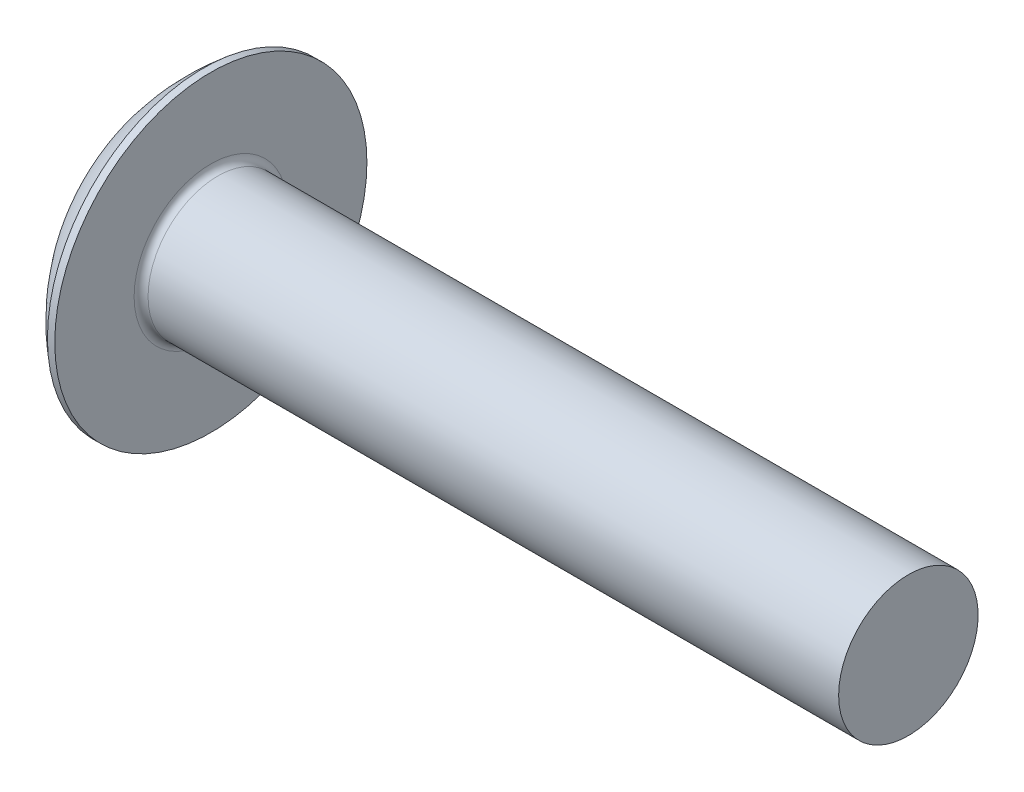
ISO-10303-21;
HEADER;
FILE_DESCRIPTION(('STEP AP214'),'2;1');
FILE_NAME('part.step','',(''),(''),'','','');
FILE_SCHEMA(('AUTOMOTIVE_DESIGN { 1 0 10303 214 1 1 1 1 }'));
ENDSEC;
DATA;
#1=APPLICATION_CONTEXT('core data for automotive mechanical design processes');
#2=APPLICATION_PROTOCOL_DEFINITION('international standard','automotive_design',2000,#1);
#3=PRODUCT_CONTEXT('',#1,'mechanical');
#4=PRODUCT('Part','Part','',(#3));
#5=PRODUCT_RELATED_PRODUCT_CATEGORY('part','',(#4));
#6=PRODUCT_DEFINITION_FORMATION('','',#4);
#7=PRODUCT_DEFINITION_CONTEXT('part definition',#1,'design');
#8=PRODUCT_DEFINITION('design','',#6,#7);
#9=PRODUCT_DEFINITION_SHAPE('','',#8);
#10=(LENGTH_UNIT() NAMED_UNIT(*) SI_UNIT(.MILLI.,.METRE.));
#11=(NAMED_UNIT(*) PLANE_ANGLE_UNIT() SI_UNIT($,.RADIAN.));
#12=(NAMED_UNIT(*) SI_UNIT($,.STERADIAN.) SOLID_ANGLE_UNIT());
#13=UNCERTAINTY_MEASURE_WITH_UNIT(LENGTH_MEASURE(1.E-05),#10,'distance_accuracy_value','');
#14=(GEOMETRIC_REPRESENTATION_CONTEXT(3) GLOBAL_UNCERTAINTY_ASSIGNED_CONTEXT((#13)) GLOBAL_UNIT_ASSIGNED_CONTEXT((#10,
#11,#12)) REPRESENTATION_CONTEXT('',''));
#15=CARTESIAN_POINT('',(0.,0.,0.));
#16=DIRECTION('',(0.,0.,1.));
#17=DIRECTION('',(1.,0.,0.));
#18=AXIS2_PLACEMENT_3D('',#15,#16,#17);
#19=CARTESIAN_POINT('',(11.5,0.,0.));
#20=DIRECTION('',(-1.,0.,0.));
#21=DIRECTION('',(0.,1.,0.));
#22=AXIS2_PLACEMENT_3D('',#19,#20,#21);
#23=SPHERICAL_SURFACE('',#22,11.5);
#24=CARTESIAN_POINT('',(4.27867740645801,0.,0.));
#25=DIRECTION('',(-1.,0.,0.));
#26=DIRECTION('',(0.,0.,1.));
#27=AXIS2_PLACEMENT_3D('',#24,#25,#26);
#28=CIRCLE('',#27,8.95);
#29=CARTESIAN_POINT('',(4.27867740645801,0.,8.95));
#30=VERTEX_POINT('',#29);
#31=EDGE_CURVE('E77',#30,#30,#28,.T.);
#32=ORIENTED_EDGE('',*,*,#31,.T.);
#33=EDGE_LOOP('',(#32));
#34=FACE_BOUND('',#33,.T.);
#35=CARTESIAN_POINT('',(2.17,0.,0.));
#36=DIRECTION('',(-1.,0.,0.));
#37=DIRECTION('',(0.,0.,1.));
#38=AXIS2_PLACEMENT_3D('',#35,#36,#37);
#39=CIRCLE('',#38,6.72317633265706);
#40=CARTESIAN_POINT('',(2.17,1.155,-6.62322240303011));
#41=VERTEX_POINT('',#40);
#42=CARTESIAN_POINT('',(2.17,-1.155,-6.62322240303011));
#43=VERTEX_POINT('',#42);
#44=EDGE_CURVE('E11',#41,#43,#39,.T.);
#45=ORIENTED_EDGE('',*,*,#44,.F.);
#46=CARTESIAN_POINT('',(11.5,1.155,0.));
#47=DIRECTION('',(0.,-1.,0.));
#48=DIRECTION('',(0.,0.,-1.));
#49=AXIS2_PLACEMENT_3D('',#46,#47,#48);
#50=CIRCLE('',#49,11.4418519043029);
#51=CARTESIAN_POINT('',(2.17,1.155,6.62322240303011));
#52=VERTEX_POINT('',#51);
#53=EDGE_CURVE('E37',#52,#41,#50,.T.);
#54=ORIENTED_EDGE('',*,*,#53,.F.);
#55=CARTESIAN_POINT('',(2.17,-1.155,6.62322240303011));
#56=VERTEX_POINT('',#55);
#57=EDGE_CURVE('E43',#56,#52,#39,.T.);
#58=ORIENTED_EDGE('',*,*,#57,.F.);
#59=CARTESIAN_POINT('',(11.5,-1.155,0.));
#60=DIRECTION('',(0.,1.,0.));
#61=DIRECTION('',(0.,0.,1.));
#62=AXIS2_PLACEMENT_3D('',#59,#60,#61);
#63=CIRCLE('',#62,11.4418519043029);
#64=EDGE_CURVE('E65',#43,#56,#63,.T.);
#65=ORIENTED_EDGE('',*,*,#64,.F.);
#66=EDGE_LOOP('',(#45,#54,#58,#65));
#67=FACE_BOUND('',#66,.T.);
#68=ADVANCED_FACE('F33',(#34,#67),#23,.T.);
#69=CARTESIAN_POINT('',(0.,0.,0.));
#70=DIRECTION('',(-1.,0.,0.));
#71=DIRECTION('',(0.,0.,1.));
#72=AXIS2_PLACEMENT_3D('',#69,#70,#71);
#73=CYLINDRICAL_SURFACE('',#72,8.95);
#74=ORIENTED_EDGE('',*,*,#31,.F.);
#75=EDGE_LOOP('',(#74));
#76=FACE_BOUND('',#75,.T.);
#77=CARTESIAN_POINT('',(4.7,0.,0.));
#78=DIRECTION('',(-1.,0.,0.));
#79=DIRECTION('',(0.,0.,1.));
#80=AXIS2_PLACEMENT_3D('',#77,#78,#79);
#81=CIRCLE('',#80,8.95);
#82=CARTESIAN_POINT('',(4.7,0.,8.95));
#83=VERTEX_POINT('',#82);
#84=EDGE_CURVE('E80',#83,#83,#81,.T.);
#85=ORIENTED_EDGE('',*,*,#84,.T.);
#86=EDGE_LOOP('',(#85));
#87=FACE_BOUND('',#86,.T.);
#88=ADVANCED_FACE('F96',(#76,#87),#73,.T.);
#89=CARTESIAN_POINT('',(4.7,8.95,0.));
#90=DIRECTION('',(-1.,0.,0.));
#91=DIRECTION('',(0.,0.,1.));
#92=AXIS2_PLACEMENT_3D('',#89,#90,#91);
#93=PLANE('',#92);
#94=CARTESIAN_POINT('',(4.7,0.,0.));
#95=DIRECTION('',(-1.,0.,0.));
#96=DIRECTION('',(0.,0.,1.));
#97=AXIS2_PLACEMENT_3D('',#94,#95,#96);
#98=CIRCLE('',#97,4.4);
#99=CARTESIAN_POINT('',(4.7,0.,4.4));
#100=VERTEX_POINT('',#99);
#101=EDGE_CURVE('E74',#100,#100,#98,.T.);
#102=ORIENTED_EDGE('',*,*,#101,.T.);
#103=EDGE_LOOP('',(#102));
#104=FACE_BOUND('',#103,.T.);
#105=ORIENTED_EDGE('',*,*,#84,.F.);
#106=EDGE_LOOP('',(#105));
#107=FACE_BOUND('',#106,.T.);
#108=ADVANCED_FACE('F101',(#104,#107),#93,.F.);
#109=CARTESIAN_POINT('',(0.,0.,0.));
#110=DIRECTION('',(-1.,0.,0.));
#111=DIRECTION('',(0.,0.,1.));
#112=AXIS2_PLACEMENT_3D('',#109,#110,#111);
#113=CYLINDRICAL_SURFACE('',#112,4.);
#114=CARTESIAN_POINT('',(5.1,0.,0.));
#115=DIRECTION('',(-1.,0.,0.));
#116=DIRECTION('',(0.,0.,1.));
#117=AXIS2_PLACEMENT_3D('',#114,#115,#116);
#118=CIRCLE('',#117,4.);
#119=CARTESIAN_POINT('',(5.1,0.,4.));
#120=VERTEX_POINT('',#119);
#121=EDGE_CURVE('E70',#120,#120,#118,.F.);
#122=ORIENTED_EDGE('',*,*,#121,.T.);
#123=EDGE_LOOP('',(#122));
#124=FACE_BOUND('',#123,.T.);
#125=CARTESIAN_POINT('',(44.7,0.,0.));
#126=DIRECTION('',(-1.,0.,0.));
#127=DIRECTION('',(0.,0.,1.));
#128=AXIS2_PLACEMENT_3D('',#125,#126,#127);
#129=CIRCLE('',#128,4.);
#130=CARTESIAN_POINT('',(44.7,0.,4.));
#131=VERTEX_POINT('',#130);
#132=EDGE_CURVE('E83',#131,#131,#129,.T.);
#133=ORIENTED_EDGE('',*,*,#132,.T.);
#134=EDGE_LOOP('',(#133));
#135=FACE_BOUND('',#134,.T.);
#136=ADVANCED_FACE('F107',(#124,#135),#113,.T.);
#137=CARTESIAN_POINT('',(44.7,4.,0.));
#138=DIRECTION('',(-1.,0.,0.));
#139=DIRECTION('',(0.,0.,1.));
#140=AXIS2_PLACEMENT_3D('',#137,#138,#139);
#141=PLANE('',#140);
#142=ORIENTED_EDGE('',*,*,#132,.F.);
#143=EDGE_LOOP('',(#142));
#144=FACE_BOUND('',#143,.T.);
#145=ADVANCED_FACE('F111',(#144),#141,.F.);
#146=CARTESIAN_POINT('',(5.1,0.,0.));
#147=DIRECTION('',(-1.,0.,0.));
#148=DIRECTION('',(0.,0.,1.));
#149=AXIS2_PLACEMENT_3D('',#146,#147,#148);
#150=TOROIDAL_SURFACE('',#149,4.4,0.4);
#151=ORIENTED_EDGE('',*,*,#121,.F.);
#152=EDGE_LOOP('',(#151));
#153=FACE_BOUND('',#152,.T.);
#154=ORIENTED_EDGE('',*,*,#101,.F.);
#155=EDGE_LOOP('',(#154));
#156=FACE_BOUND('',#155,.T.);
#157=ADVANCED_FACE('F35',(#153,#156),#150,.F.);
#158=CARTESIAN_POINT('',(2.17,1.155,-8.95));
#159=DIRECTION('',(0.,-1.,0.));
#160=DIRECTION('',(0.,0.,-1.));
#161=AXIS2_PLACEMENT_3D('',#158,#159,#160);
#162=PLANE('',#161);
#163=ORIENTED_EDGE('',*,*,#53,.T.);
#164=DIRECTION('',(0.,0.,1.));
#165=VECTOR('',#164,1.);
#166=CARTESIAN_POINT('',(2.17,1.155,-8.95));
#167=LINE('',#166,#165);
#168=EDGE_CURVE('E62',#41,#52,#167,.T.);
#169=ORIENTED_EDGE('',*,*,#168,.T.);
#170=EDGE_LOOP('',(#163,#169));
#171=FACE_BOUND('',#170,.T.);
#172=ADVANCED_FACE('F61',(#171),#162,.T.);
#173=CARTESIAN_POINT('',(2.17,-1.155,-8.95));
#174=DIRECTION('',(0.,1.,0.));
#175=DIRECTION('',(0.,0.,1.));
#176=AXIS2_PLACEMENT_3D('',#173,#174,#175);
#177=PLANE('',#176);
#178=ORIENTED_EDGE('',*,*,#64,.T.);
#179=DIRECTION('',(0.,0.,-1.));
#180=VECTOR('',#179,1.);
#181=CARTESIAN_POINT('',(2.17,-1.155,-8.95));
#182=LINE('',#181,#180);
#183=EDGE_CURVE('E49',#56,#43,#182,.T.);
#184=ORIENTED_EDGE('',*,*,#183,.T.);
#185=EDGE_LOOP('',(#178,#184));
#186=FACE_BOUND('',#185,.T.);
#187=ADVANCED_FACE('F86',(#186),#177,.T.);
#188=CARTESIAN_POINT('',(2.17,-1.155,-8.95));
#189=DIRECTION('',(-1.,0.,0.));
#190=DIRECTION('',(0.,0.,1.));
#191=AXIS2_PLACEMENT_3D('',#188,#189,#190);
#192=PLANE('',#191);
#193=ORIENTED_EDGE('',*,*,#44,.T.);
#194=ORIENTED_EDGE('',*,*,#183,.F.);
#195=ORIENTED_EDGE('',*,*,#57,.T.);
#196=ORIENTED_EDGE('',*,*,#168,.F.);
#197=EDGE_LOOP('',(#193,#194,#195,#196));
#198=FACE_BOUND('',#197,.T.);
#199=ADVANCED_FACE('F66',(#198),#192,.T.);
#200=CLOSED_SHELL('',(#68,#88,#108,#136,#145,#157,#172,#187,#199));
#201=MANIFOLD_SOLID_BREP('B2',#200);
#202=ADVANCED_BREP_SHAPE_REPRESENTATION('',(#18,#201),#14);
#203=SHAPE_DEFINITION_REPRESENTATION(#9,#202);
ENDSEC;
END-ISO-10303-21;
